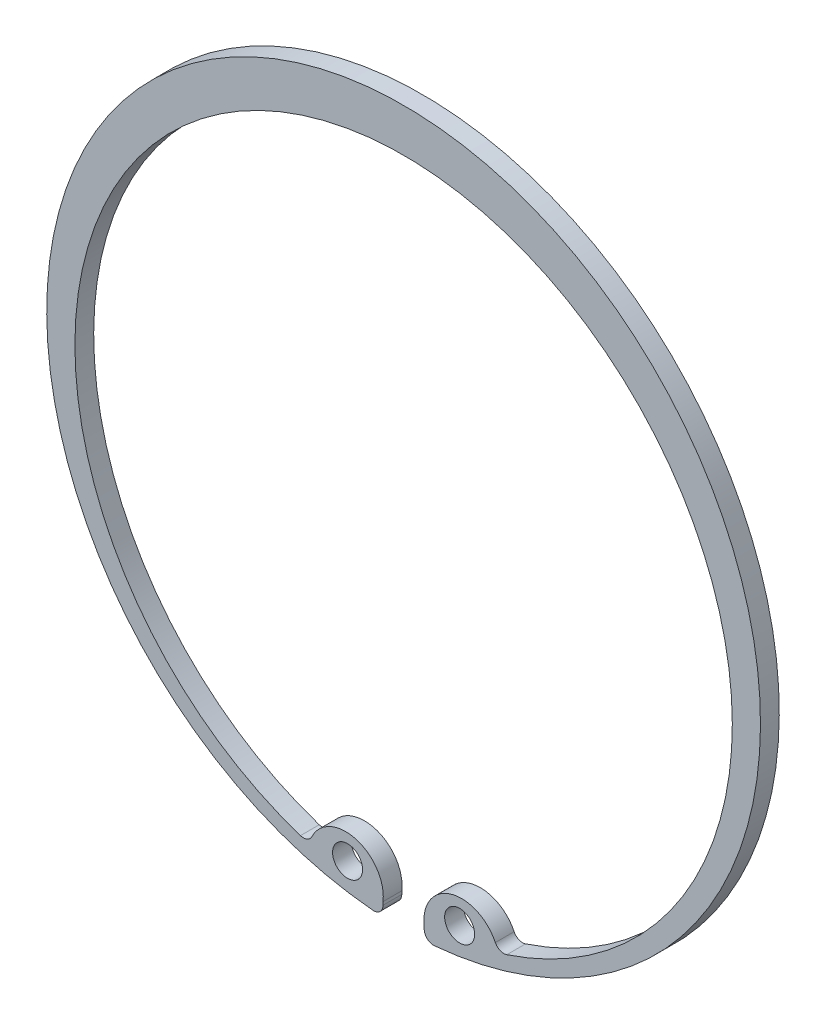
from build123d import *

# Parameters (mm, degrees)
EXTRUSION1_DEPTH        = 1
CONG_1_R                = 0.5
ESQUISSE3_R             = 0.798800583
ENL_V_MAT_EXTRU_2_DEPTH = 1


with BuildPart() as part:
    # Esquisse1 → Extrusion1 (new body)
    with BuildSketch(Plane.XY):
        with BuildLine():
            Line((-1.096952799, -18.968307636), (-1.096952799, -18.265586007))
            ThreePointArc((-1.096952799, -18.265586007), (-2.73029794, -16.057636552), (-5.02797364, -17.562144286))
            ThreePointArc((-5.02797364, -17.562144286), (0, 16.7), (5.02797364, -17.562144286))
            ThreePointArc((5.02797364, -17.562144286), (2.73029794, -16.057636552), (1.096952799, -18.265586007))
            Line((1.096952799, -18.265586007), (1.096952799, -18.968307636))
            ThreePointArc((1.096952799, -18.968307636), (0, 19), (-1.096952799, -18.968307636))
        make_face()
    extrude(amount=EXTRUSION1_DEPTH)

    # Cong_1
    cong_1_edges = [part.edges().sort_by_distance(p)[0] for p in [
        (5.02797364, -17.562144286, 0.5),
        (-5.02797364, -17.562144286, 0.5),
        (-1.096952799, -18.968307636, 0.5),
        (1.096952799, -18.968307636, 0.5),
    ]]
    fillet(cong_1_edges, radius=CONG_1_R)

    # Esquisse3 → Enl_v. mat.-Extru.2 (cut)
    with BuildSketch(Plane.XY.offset(1)):
        with Locations((-2.983283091, -17.332126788)):
            Circle(ESQUISSE3_R)
    enl_v_mat_extru_2 = extrude(amount=-ENL_V_MAT_EXTRU_2_DEPTH, mode=Mode.SUBTRACT)

    # Sym_trie1: Enl_v. mat.-Extru.2 across plane
    add(enl_v_mat_extru_2.mirror(Plane(origin=(0, 0, 0), x_dir=(0, 0, 1), z_dir=(1, 0, 0))), mode=Mode.SUBTRACT)


solid = part.part
